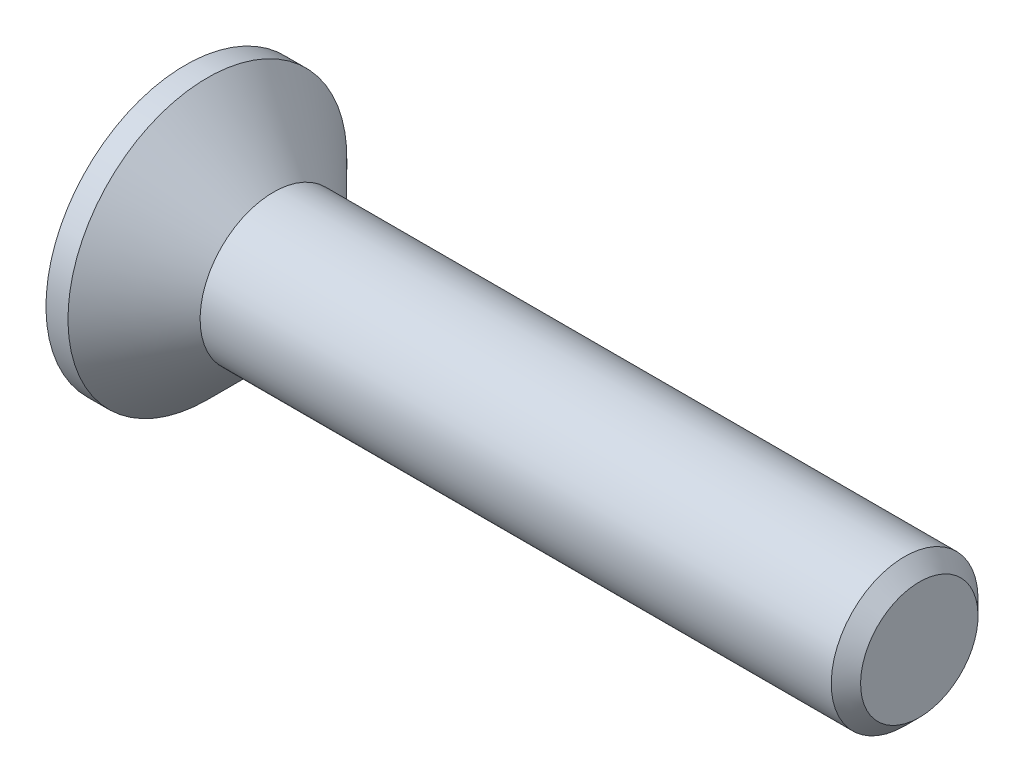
ISO-10303-21;
HEADER;
FILE_DESCRIPTION(('STEP AP214'),'2;1');
FILE_NAME('part.step','',(''),(''),'','','');
FILE_SCHEMA(('AUTOMOTIVE_DESIGN { 1 0 10303 214 1 1 1 1 }'));
ENDSEC;
DATA;
#1=APPLICATION_CONTEXT('core data for automotive mechanical design processes');
#2=APPLICATION_PROTOCOL_DEFINITION('international standard','automotive_design',2000,#1);
#3=PRODUCT_CONTEXT('',#1,'mechanical');
#4=PRODUCT('Part','Part','',(#3));
#5=PRODUCT_RELATED_PRODUCT_CATEGORY('part','',(#4));
#6=PRODUCT_DEFINITION_FORMATION('','',#4);
#7=PRODUCT_DEFINITION_CONTEXT('part definition',#1,'design');
#8=PRODUCT_DEFINITION('design','',#6,#7);
#9=PRODUCT_DEFINITION_SHAPE('','',#8);
#10=(LENGTH_UNIT() NAMED_UNIT(*) SI_UNIT(.MILLI.,.METRE.));
#11=(NAMED_UNIT(*) PLANE_ANGLE_UNIT() SI_UNIT($,.RADIAN.));
#12=(NAMED_UNIT(*) SI_UNIT($,.STERADIAN.) SOLID_ANGLE_UNIT());
#13=UNCERTAINTY_MEASURE_WITH_UNIT(LENGTH_MEASURE(1.E-05),#10,'distance_accuracy_value','');
#14=(GEOMETRIC_REPRESENTATION_CONTEXT(3) GLOBAL_UNCERTAINTY_ASSIGNED_CONTEXT((#13)) GLOBAL_UNIT_ASSIGNED_CONTEXT((#10,
#11,#12)) REPRESENTATION_CONTEXT('',''));
#15=CARTESIAN_POINT('',(0.,0.,0.));
#16=DIRECTION('',(0.,0.,1.));
#17=DIRECTION('',(1.,0.,0.));
#18=AXIS2_PLACEMENT_3D('',#15,#16,#17);
#19=CARTESIAN_POINT('',(0.,0.,0.));
#20=DIRECTION('',(-1.,0.,0.));
#21=DIRECTION('',(0.,-1.,0.));
#22=AXIS2_PLACEMENT_3D('',#19,#20,#21);
#23=CONICAL_SURFACE('',#22,1.,0.78539816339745);
#24=CARTESIAN_POINT('',(-0.899999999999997,0.,0.));
#25=DIRECTION('',(-1.,0.,0.));
#26=DIRECTION('',(0.,-1.,0.));
#27=AXIS2_PLACEMENT_3D('',#24,#25,#26);
#28=CIRCLE('',#27,1.9);
#29=CARTESIAN_POINT('',(-0.899999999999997,-1.9,0.));
#30=VERTEX_POINT('',#29);
#31=EDGE_CURVE('E189',#30,#30,#28,.T.);
#32=ORIENTED_EDGE('',*,*,#31,.F.);
#33=EDGE_LOOP('',(#32));
#34=FACE_BOUND('',#33,.T.);
#35=CARTESIAN_POINT('',(0.,0.,0.));
#36=DIRECTION('',(-1.,0.,0.));
#37=DIRECTION('',(0.,-1.,0.));
#38=AXIS2_PLACEMENT_3D('',#35,#36,#37);
#39=CIRCLE('',#38,1.);
#40=CARTESIAN_POINT('',(0.,-1.,0.));
#41=VERTEX_POINT('',#40);
#42=EDGE_CURVE('E212',#41,#41,#39,.T.);
#43=ORIENTED_EDGE('',*,*,#42,.T.);
#44=EDGE_LOOP('',(#43));
#45=FACE_BOUND('',#44,.T.);
#46=ADVANCED_FACE('F33',(#34,#45),#23,.T.);
#47=CARTESIAN_POINT('',(-1.2,0.,0.));
#48=DIRECTION('',(-1.,0.,0.));
#49=DIRECTION('',(0.,-1.,0.));
#50=AXIS2_PLACEMENT_3D('',#47,#48,#49);
#51=CYLINDRICAL_SURFACE('',#50,1.);
#52=CARTESIAN_POINT('',(8.6,0.,0.));
#53=DIRECTION('',(-1.,0.,0.));
#54=DIRECTION('',(0.,-1.,0.));
#55=AXIS2_PLACEMENT_3D('',#52,#53,#54);
#56=CIRCLE('',#55,1.);
#57=CARTESIAN_POINT('',(8.6,-1.,0.));
#58=VERTEX_POINT('',#57);
#59=EDGE_CURVE('E41',#58,#58,#56,.T.);
#60=ORIENTED_EDGE('',*,*,#59,.T.);
#61=EDGE_LOOP('',(#60));
#62=FACE_BOUND('',#61,.T.);
#63=ORIENTED_EDGE('',*,*,#42,.F.);
#64=EDGE_LOOP('',(#63));
#65=FACE_BOUND('',#64,.T.);
#66=ADVANCED_FACE('F217',(#62,#65),#51,.T.);
#67=CARTESIAN_POINT('',(8.8,0.,0.));
#68=DIRECTION('',(-1.,0.,0.));
#69=DIRECTION('',(0.,-1.,0.));
#70=AXIS2_PLACEMENT_3D('',#67,#68,#69);
#71=PLANE('',#70);
#72=CARTESIAN_POINT('',(8.8,0.,0.));
#73=DIRECTION('',(-1.,0.,0.));
#74=DIRECTION('',(0.,-1.,0.));
#75=AXIS2_PLACEMENT_3D('',#72,#73,#74);
#76=CIRCLE('',#75,0.799999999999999);
#77=CARTESIAN_POINT('',(8.8,-0.799999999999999,0.));
#78=VERTEX_POINT('',#77);
#79=EDGE_CURVE('E11',#78,#78,#76,.F.);
#80=ORIENTED_EDGE('',*,*,#79,.T.);
#81=EDGE_LOOP('',(#80));
#82=FACE_BOUND('',#81,.T.);
#83=ADVANCED_FACE('F239',(#82),#71,.F.);
#84=CARTESIAN_POINT('',(-1.2,1.9,0.));
#85=DIRECTION('',(1.,0.,0.));
#86=DIRECTION('',(0.,1.,0.));
#87=AXIS2_PLACEMENT_3D('',#84,#85,#86);
#88=PLANE('',#87);
#89=DIRECTION('',(0.,0.,-1.));
#90=VECTOR('',#89,1.);
#91=CARTESIAN_POINT('',(-1.2,0.3,-1.175));
#92=LINE('',#91,#90);
#93=CARTESIAN_POINT('',(-1.2,0.3,-0.3));
#94=VERTEX_POINT('',#93);
#95=CARTESIAN_POINT('',(-1.2,0.3,-1.175));
#96=VERTEX_POINT('',#95);
#97=EDGE_CURVE('E158',#94,#96,#92,.T.);
#98=ORIENTED_EDGE('',*,*,#97,.F.);
#99=DIRECTION('',(0.,-1.,0.));
#100=VECTOR('',#99,1.);
#101=CARTESIAN_POINT('',(-1.2,0.3,-0.3));
#102=LINE('',#101,#100);
#103=CARTESIAN_POINT('',(-1.2,1.175,-0.3));
#104=VERTEX_POINT('',#103);
#105=EDGE_CURVE('E48',#104,#94,#102,.T.);
#106=ORIENTED_EDGE('',*,*,#105,.F.);
#107=DIRECTION('',(0.,0.,-1.));
#108=VECTOR('',#107,1.);
#109=CARTESIAN_POINT('',(-1.2,1.175,-0.3));
#110=LINE('',#109,#108);
#111=CARTESIAN_POINT('',(-1.2,1.175,0.3));
#112=VERTEX_POINT('',#111);
#113=EDGE_CURVE('E185',#112,#104,#110,.T.);
#114=ORIENTED_EDGE('',*,*,#113,.F.);
#115=DIRECTION('',(0.,1.,0.));
#116=VECTOR('',#115,1.);
#117=CARTESIAN_POINT('',(-1.2,1.175,0.3));
#118=LINE('',#117,#116);
#119=CARTESIAN_POINT('',(-1.2,0.3,0.3));
#120=VERTEX_POINT('',#119);
#121=EDGE_CURVE('E183',#120,#112,#118,.T.);
#122=ORIENTED_EDGE('',*,*,#121,.F.);
#123=DIRECTION('',(0.,0.,-1.));
#124=VECTOR('',#123,1.);
#125=CARTESIAN_POINT('',(-1.2,0.3,0.3));
#126=LINE('',#125,#124);
#127=CARTESIAN_POINT('',(-1.2,0.3,1.175));
#128=VERTEX_POINT('',#127);
#129=EDGE_CURVE('E132',#128,#120,#126,.T.);
#130=ORIENTED_EDGE('',*,*,#129,.F.);
#131=DIRECTION('',(0.,1.,0.));
#132=VECTOR('',#131,1.);
#133=CARTESIAN_POINT('',(-1.2,0.3,1.175));
#134=LINE('',#133,#132);
#135=CARTESIAN_POINT('',(-1.2,-0.3,1.175));
#136=VERTEX_POINT('',#135);
#137=EDGE_CURVE('E179',#136,#128,#134,.T.);
#138=ORIENTED_EDGE('',*,*,#137,.F.);
#139=DIRECTION('',(0.,0.,1.));
#140=VECTOR('',#139,1.);
#141=CARTESIAN_POINT('',(-1.2,-0.3,1.175));
#142=LINE('',#141,#140);
#143=CARTESIAN_POINT('',(-1.2,-0.3,0.3));
#144=VERTEX_POINT('',#143);
#145=EDGE_CURVE('E176',#144,#136,#142,.T.);
#146=ORIENTED_EDGE('',*,*,#145,.F.);
#147=DIRECTION('',(0.,1.,0.));
#148=VECTOR('',#147,1.);
#149=CARTESIAN_POINT('',(-1.2,-0.3,0.3));
#150=LINE('',#149,#148);
#151=CARTESIAN_POINT('',(-1.2,-1.175,0.3));
#152=VERTEX_POINT('',#151);
#153=EDGE_CURVE('E173',#152,#144,#150,.T.);
#154=ORIENTED_EDGE('',*,*,#153,.F.);
#155=DIRECTION('',(0.,0.,1.));
#156=VECTOR('',#155,1.);
#157=CARTESIAN_POINT('',(-1.2,-1.175,0.3));
#158=LINE('',#157,#156);
#159=CARTESIAN_POINT('',(-1.2,-1.175,-0.3));
#160=VERTEX_POINT('',#159);
#161=EDGE_CURVE('E170',#160,#152,#158,.T.);
#162=ORIENTED_EDGE('',*,*,#161,.F.);
#163=DIRECTION('',(0.,-1.,0.));
#164=VECTOR('',#163,1.);
#165=CARTESIAN_POINT('',(-1.2,-1.175,-0.3));
#166=LINE('',#165,#164);
#167=CARTESIAN_POINT('',(-1.2,-0.3,-0.3));
#168=VERTEX_POINT('',#167);
#169=EDGE_CURVE('E167',#168,#160,#166,.T.);
#170=ORIENTED_EDGE('',*,*,#169,.F.);
#171=DIRECTION('',(0.,0.,1.));
#172=VECTOR('',#171,1.);
#173=CARTESIAN_POINT('',(-1.2,-0.3,-0.3));
#174=LINE('',#173,#172);
#175=CARTESIAN_POINT('',(-1.2,-0.3,-1.175));
#176=VERTEX_POINT('',#175);
#177=EDGE_CURVE('E164',#176,#168,#174,.T.);
#178=ORIENTED_EDGE('',*,*,#177,.F.);
#179=DIRECTION('',(0.,-1.,0.));
#180=VECTOR('',#179,1.);
#181=CARTESIAN_POINT('',(-1.2,-0.3,-1.175));
#182=LINE('',#181,#180);
#183=EDGE_CURVE('E161',#96,#176,#182,.T.);
#184=ORIENTED_EDGE('',*,*,#183,.F.);
#185=EDGE_LOOP('',(#98,#106,#114,#122,#130,#138,#146,#154,#162,#170,#178,#184));
#186=FACE_BOUND('',#185,.T.);
#187=CARTESIAN_POINT('',(-1.2,0.,0.));
#188=DIRECTION('',(-1.,0.,0.));
#189=DIRECTION('',(0.,-1.,0.));
#190=AXIS2_PLACEMENT_3D('',#187,#188,#189);
#191=CIRCLE('',#190,1.9);
#192=CARTESIAN_POINT('',(-1.2,-1.9,0.));
#193=VERTEX_POINT('',#192);
#194=EDGE_CURVE('E209',#193,#193,#191,.T.);
#195=ORIENTED_EDGE('',*,*,#194,.T.);
#196=EDGE_LOOP('',(#195));
#197=FACE_BOUND('',#196,.T.);
#198=ADVANCED_FACE('F230',(#186,#197),#88,.F.);
#199=CARTESIAN_POINT('',(-1.2,0.,0.));
#200=DIRECTION('',(-1.,0.,0.));
#201=DIRECTION('',(0.,-1.,0.));
#202=AXIS2_PLACEMENT_3D('',#199,#200,#201);
#203=CYLINDRICAL_SURFACE('',#202,1.9);
#204=ORIENTED_EDGE('',*,*,#194,.F.);
#205=EDGE_LOOP('',(#204));
#206=FACE_BOUND('',#205,.T.);
#207=ORIENTED_EDGE('',*,*,#31,.T.);
#208=EDGE_LOOP('',(#207));
#209=FACE_BOUND('',#208,.T.);
#210=ADVANCED_FACE('F222',(#206,#209),#203,.T.);
#211=CARTESIAN_POINT('',(8.6,0.,0.));
#212=DIRECTION('',(-1.,0.,0.));
#213=DIRECTION('',(0.,-1.,0.));
#214=AXIS2_PLACEMENT_3D('',#211,#212,#213);
#215=CONICAL_SURFACE('',#214,1.,0.785398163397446);
#216=ORIENTED_EDGE('',*,*,#79,.F.);
#217=EDGE_LOOP('',(#216));
#218=FACE_BOUND('',#217,.T.);
#219=ORIENTED_EDGE('',*,*,#59,.F.);
#220=EDGE_LOOP('',(#219));
#221=FACE_BOUND('',#220,.T.);
#222=ADVANCED_FACE('F35',(#218,#221),#215,.T.);
#223=CARTESIAN_POINT('',(-0.249999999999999,0.3,-0.3));
#224=DIRECTION('',(0.,0.,-1.));
#225=DIRECTION('',(0.,1.,0.));
#226=AXIS2_PLACEMENT_3D('',#223,#224,#225);
#227=PLANE('',#226);
#228=ORIENTED_EDGE('',*,*,#105,.T.);
#229=DIRECTION('',(-1.,0.,0.));
#230=VECTOR('',#229,1.);
#231=CARTESIAN_POINT('',(-0.249999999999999,0.3,-0.3));
#232=LINE('',#231,#230);
#233=CARTESIAN_POINT('',(-0.249999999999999,0.3,-0.3));
#234=VERTEX_POINT('',#233);
#235=EDGE_CURVE('E96',#234,#94,#232,.T.);
#236=ORIENTED_EDGE('',*,*,#235,.F.);
#237=DIRECTION('',(0.,-1.,0.));
#238=VECTOR('',#237,1.);
#239=CARTESIAN_POINT('',(-0.249999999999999,0.3,-0.3));
#240=LINE('',#239,#238);
#241=CARTESIAN_POINT('',(-0.249999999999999,1.175,-0.3));
#242=VERTEX_POINT('',#241);
#243=EDGE_CURVE('E187',#242,#234,#240,.T.);
#244=ORIENTED_EDGE('',*,*,#243,.F.);
#245=DIRECTION('',(-1.,0.,0.));
#246=VECTOR('',#245,1.);
#247=CARTESIAN_POINT('',(-0.249999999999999,1.175,-0.3));
#248=LINE('',#247,#246);
#249=EDGE_CURVE('E56',#242,#104,#248,.T.);
#250=ORIENTED_EDGE('',*,*,#249,.T.);
#251=EDGE_LOOP('',(#228,#236,#244,#250));
#252=FACE_BOUND('',#251,.T.);
#253=ADVANCED_FACE('F221',(#252),#227,.F.);
#254=CARTESIAN_POINT('',(-0.249999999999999,1.175,-0.3));
#255=DIRECTION('',(0.,1.,0.));
#256=DIRECTION('',(-1.,0.,0.));
#257=AXIS2_PLACEMENT_3D('',#254,#255,#256);
#258=PLANE('',#257);
#259=ORIENTED_EDGE('',*,*,#113,.T.);
#260=ORIENTED_EDGE('',*,*,#249,.F.);
#261=DIRECTION('',(0.,0.,-1.));
#262=VECTOR('',#261,1.);
#263=CARTESIAN_POINT('',(-0.249999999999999,1.175,-0.3));
#264=LINE('',#263,#262);
#265=CARTESIAN_POINT('',(-0.249999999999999,1.175,0.3));
#266=VERTEX_POINT('',#265);
#267=EDGE_CURVE('E144',#266,#242,#264,.T.);
#268=ORIENTED_EDGE('',*,*,#267,.F.);
#269=DIRECTION('',(-1.,0.,0.));
#270=VECTOR('',#269,1.);
#271=CARTESIAN_POINT('',(-0.249999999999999,1.175,0.3));
#272=LINE('',#271,#270);
#273=EDGE_CURVE('E136',#266,#112,#272,.T.);
#274=ORIENTED_EDGE('',*,*,#273,.T.);
#275=EDGE_LOOP('',(#259,#260,#268,#274));
#276=FACE_BOUND('',#275,.T.);
#277=ADVANCED_FACE('F228',(#276),#258,.F.);
#278=CARTESIAN_POINT('',(-0.249999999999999,1.175,0.3));
#279=DIRECTION('',(0.,0.,1.));
#280=DIRECTION('',(0.,-1.,0.));
#281=AXIS2_PLACEMENT_3D('',#278,#279,#280);
#282=PLANE('',#281);
#283=ORIENTED_EDGE('',*,*,#121,.T.);
#284=ORIENTED_EDGE('',*,*,#273,.F.);
#285=DIRECTION('',(0.,1.,0.));
#286=VECTOR('',#285,1.);
#287=CARTESIAN_POINT('',(-0.249999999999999,1.175,0.3));
#288=LINE('',#287,#286);
#289=CARTESIAN_POINT('',(-0.249999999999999,0.3,0.3));
#290=VERTEX_POINT('',#289);
#291=EDGE_CURVE('E140',#290,#266,#288,.T.);
#292=ORIENTED_EDGE('',*,*,#291,.F.);
#293=DIRECTION('',(-1.,0.,0.));
#294=VECTOR('',#293,1.);
#295=CARTESIAN_POINT('',(-0.249999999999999,0.3,0.3));
#296=LINE('',#295,#294);
#297=EDGE_CURVE('E125',#290,#120,#296,.T.);
#298=ORIENTED_EDGE('',*,*,#297,.T.);
#299=EDGE_LOOP('',(#283,#284,#292,#298));
#300=FACE_BOUND('',#299,.T.);
#301=ADVANCED_FACE('F141',(#300),#282,.F.);
#302=CARTESIAN_POINT('',(-0.249999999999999,0.3,0.3));
#303=DIRECTION('',(0.,1.,0.));
#304=DIRECTION('',(0.,0.,1.));
#305=AXIS2_PLACEMENT_3D('',#302,#303,#304);
#306=PLANE('',#305);
#307=ORIENTED_EDGE('',*,*,#129,.T.);
#308=ORIENTED_EDGE('',*,*,#297,.F.);
#309=DIRECTION('',(0.,0.,-1.));
#310=VECTOR('',#309,1.);
#311=CARTESIAN_POINT('',(-0.249999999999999,0.3,0.3));
#312=LINE('',#311,#310);
#313=CARTESIAN_POINT('',(-0.249999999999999,0.3,1.175));
#314=VERTEX_POINT('',#313);
#315=EDGE_CURVE('E129',#314,#290,#312,.T.);
#316=ORIENTED_EDGE('',*,*,#315,.F.);
#317=DIRECTION('',(-1.,0.,0.));
#318=VECTOR('',#317,1.);
#319=CARTESIAN_POINT('',(-0.249999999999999,0.3,1.175));
#320=LINE('',#319,#318);
#321=EDGE_CURVE('E137',#314,#128,#320,.T.);
#322=ORIENTED_EDGE('',*,*,#321,.T.);
#323=EDGE_LOOP('',(#307,#308,#316,#322));
#324=FACE_BOUND('',#323,.T.);
#325=ADVANCED_FACE('F127',(#324),#306,.F.);
#326=CARTESIAN_POINT('',(-0.249999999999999,0.3,1.175));
#327=DIRECTION('',(0.,0.,1.));
#328=DIRECTION('',(1.,0.,0.));
#329=AXIS2_PLACEMENT_3D('',#326,#327,#328);
#330=PLANE('',#329);
#331=ORIENTED_EDGE('',*,*,#137,.T.);
#332=ORIENTED_EDGE('',*,*,#321,.F.);
#333=DIRECTION('',(0.,1.,0.));
#334=VECTOR('',#333,1.);
#335=CARTESIAN_POINT('',(-0.249999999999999,0.3,1.175));
#336=LINE('',#335,#334);
#337=CARTESIAN_POINT('',(-0.249999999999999,-0.3,1.175));
#338=VERTEX_POINT('',#337);
#339=EDGE_CURVE('E150',#338,#314,#336,.T.);
#340=ORIENTED_EDGE('',*,*,#339,.F.);
#341=DIRECTION('',(-1.,0.,0.));
#342=VECTOR('',#341,1.);
#343=CARTESIAN_POINT('',(-0.249999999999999,-0.3,1.175));
#344=LINE('',#343,#342);
#345=EDGE_CURVE('E192',#338,#136,#344,.T.);
#346=ORIENTED_EDGE('',*,*,#345,.T.);
#347=EDGE_LOOP('',(#331,#332,#340,#346));
#348=FACE_BOUND('',#347,.T.);
#349=ADVANCED_FACE('F277',(#348),#330,.F.);
#350=CARTESIAN_POINT('',(-0.249999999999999,-0.3,1.175));
#351=DIRECTION('',(0.,-1.,0.));
#352=DIRECTION('',(0.,0.,-1.));
#353=AXIS2_PLACEMENT_3D('',#350,#351,#352);
#354=PLANE('',#353);
#355=ORIENTED_EDGE('',*,*,#145,.T.);
#356=ORIENTED_EDGE('',*,*,#345,.F.);
#357=DIRECTION('',(0.,0.,1.));
#358=VECTOR('',#357,1.);
#359=CARTESIAN_POINT('',(-0.249999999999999,-0.3,1.175));
#360=LINE('',#359,#358);
#361=CARTESIAN_POINT('',(-0.249999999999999,-0.3,0.3));
#362=VERTEX_POINT('',#361);
#363=EDGE_CURVE('E152',#362,#338,#360,.T.);
#364=ORIENTED_EDGE('',*,*,#363,.F.);
#365=DIRECTION('',(-1.,0.,0.));
#366=VECTOR('',#365,1.);
#367=CARTESIAN_POINT('',(-0.249999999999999,-0.3,0.3));
#368=LINE('',#367,#366);
#369=EDGE_CURVE('E194',#362,#144,#368,.T.);
#370=ORIENTED_EDGE('',*,*,#369,.T.);
#371=EDGE_LOOP('',(#355,#356,#364,#370));
#372=FACE_BOUND('',#371,.T.);
#373=ADVANCED_FACE('F273',(#372),#354,.F.);
#374=CARTESIAN_POINT('',(-0.249999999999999,-0.3,0.3));
#375=DIRECTION('',(0.,0.,1.));
#376=DIRECTION('',(1.,0.,0.));
#377=AXIS2_PLACEMENT_3D('',#374,#375,#376);
#378=PLANE('',#377);
#379=ORIENTED_EDGE('',*,*,#153,.T.);
#380=ORIENTED_EDGE('',*,*,#369,.F.);
#381=DIRECTION('',(0.,1.,0.));
#382=VECTOR('',#381,1.);
#383=CARTESIAN_POINT('',(-0.249999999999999,-0.3,0.3));
#384=LINE('',#383,#382);
#385=CARTESIAN_POINT('',(-0.249999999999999,-1.175,0.3));
#386=VERTEX_POINT('',#385);
#387=EDGE_CURVE('E422',#386,#362,#384,.T.);
#388=ORIENTED_EDGE('',*,*,#387,.F.);
#389=DIRECTION('',(-1.,0.,0.));
#390=VECTOR('',#389,1.);
#391=CARTESIAN_POINT('',(-0.249999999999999,-1.175,0.3));
#392=LINE('',#391,#390);
#393=EDGE_CURVE('E196',#386,#152,#392,.T.);
#394=ORIENTED_EDGE('',*,*,#393,.T.);
#395=EDGE_LOOP('',(#379,#380,#388,#394));
#396=FACE_BOUND('',#395,.T.);
#397=ADVANCED_FACE('F269',(#396),#378,.F.);
#398=CARTESIAN_POINT('',(-0.249999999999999,-1.175,0.3));
#399=DIRECTION('',(0.,-1.,0.));
#400=DIRECTION('',(1.,0.,0.));
#401=AXIS2_PLACEMENT_3D('',#398,#399,#400);
#402=PLANE('',#401);
#403=ORIENTED_EDGE('',*,*,#161,.T.);
#404=ORIENTED_EDGE('',*,*,#393,.F.);
#405=DIRECTION('',(0.,0.,1.));
#406=VECTOR('',#405,1.);
#407=CARTESIAN_POINT('',(-0.249999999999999,-1.175,0.3));
#408=LINE('',#407,#406);
#409=CARTESIAN_POINT('',(-0.249999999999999,-1.175,-0.3));
#410=VERTEX_POINT('',#409);
#411=EDGE_CURVE('E419',#410,#386,#408,.T.);
#412=ORIENTED_EDGE('',*,*,#411,.F.);
#413=DIRECTION('',(-1.,0.,0.));
#414=VECTOR('',#413,1.);
#415=CARTESIAN_POINT('',(-0.249999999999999,-1.175,-0.3));
#416=LINE('',#415,#414);
#417=EDGE_CURVE('E198',#410,#160,#416,.T.);
#418=ORIENTED_EDGE('',*,*,#417,.T.);
#419=EDGE_LOOP('',(#403,#404,#412,#418));
#420=FACE_BOUND('',#419,.T.);
#421=ADVANCED_FACE('F265',(#420),#402,.F.);
#422=CARTESIAN_POINT('',(-0.249999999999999,-1.175,-0.3));
#423=DIRECTION('',(0.,0.,-1.));
#424=DIRECTION('',(0.,1.,0.));
#425=AXIS2_PLACEMENT_3D('',#422,#423,#424);
#426=PLANE('',#425);
#427=ORIENTED_EDGE('',*,*,#169,.T.);
#428=ORIENTED_EDGE('',*,*,#417,.F.);
#429=DIRECTION('',(0.,-1.,0.));
#430=VECTOR('',#429,1.);
#431=CARTESIAN_POINT('',(-0.249999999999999,-1.175,-0.3));
#432=LINE('',#431,#430);
#433=CARTESIAN_POINT('',(-0.249999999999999,-0.3,-0.3));
#434=VERTEX_POINT('',#433);
#435=EDGE_CURVE('E416',#434,#410,#432,.T.);
#436=ORIENTED_EDGE('',*,*,#435,.F.);
#437=DIRECTION('',(-1.,0.,0.));
#438=VECTOR('',#437,1.);
#439=CARTESIAN_POINT('',(-0.249999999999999,-0.3,-0.3));
#440=LINE('',#439,#438);
#441=EDGE_CURVE('E200',#434,#168,#440,.T.);
#442=ORIENTED_EDGE('',*,*,#441,.T.);
#443=EDGE_LOOP('',(#427,#428,#436,#442));
#444=FACE_BOUND('',#443,.T.);
#445=ADVANCED_FACE('F261',(#444),#426,.F.);
#446=CARTESIAN_POINT('',(-0.249999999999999,-0.3,-0.3));
#447=DIRECTION('',(0.,-1.,0.));
#448=DIRECTION('',(0.,0.,-1.));
#449=AXIS2_PLACEMENT_3D('',#446,#447,#448);
#450=PLANE('',#449);
#451=ORIENTED_EDGE('',*,*,#177,.T.);
#452=ORIENTED_EDGE('',*,*,#441,.F.);
#453=DIRECTION('',(0.,0.,1.));
#454=VECTOR('',#453,1.);
#455=CARTESIAN_POINT('',(-0.249999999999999,-0.3,-0.3));
#456=LINE('',#455,#454);
#457=CARTESIAN_POINT('',(-0.249999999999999,-0.3,-1.175));
#458=VERTEX_POINT('',#457);
#459=EDGE_CURVE('E413',#458,#434,#456,.T.);
#460=ORIENTED_EDGE('',*,*,#459,.F.);
#461=DIRECTION('',(-1.,0.,0.));
#462=VECTOR('',#461,1.);
#463=CARTESIAN_POINT('',(-0.249999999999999,-0.3,-1.175));
#464=LINE('',#463,#462);
#465=EDGE_CURVE('E202',#458,#176,#464,.T.);
#466=ORIENTED_EDGE('',*,*,#465,.T.);
#467=EDGE_LOOP('',(#451,#452,#460,#466));
#468=FACE_BOUND('',#467,.T.);
#469=ADVANCED_FACE('F257',(#468),#450,.F.);
#470=CARTESIAN_POINT('',(-0.249999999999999,-0.3,-1.175));
#471=DIRECTION('',(0.,0.,-1.));
#472=DIRECTION('',(-1.,0.,0.));
#473=AXIS2_PLACEMENT_3D('',#470,#471,#472);
#474=PLANE('',#473);
#475=ORIENTED_EDGE('',*,*,#183,.T.);
#476=ORIENTED_EDGE('',*,*,#465,.F.);
#477=DIRECTION('',(0.,-1.,0.));
#478=VECTOR('',#477,1.);
#479=CARTESIAN_POINT('',(-0.249999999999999,-0.3,-1.175));
#480=LINE('',#479,#478);
#481=CARTESIAN_POINT('',(-0.249999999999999,0.3,-1.175));
#482=VERTEX_POINT('',#481);
#483=EDGE_CURVE('E408',#482,#458,#480,.T.);
#484=ORIENTED_EDGE('',*,*,#483,.F.);
#485=DIRECTION('',(-1.,0.,0.));
#486=VECTOR('',#485,1.);
#487=CARTESIAN_POINT('',(-0.249999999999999,0.3,-1.175));
#488=LINE('',#487,#486);
#489=EDGE_CURVE('E204',#482,#96,#488,.T.);
#490=ORIENTED_EDGE('',*,*,#489,.T.);
#491=EDGE_LOOP('',(#475,#476,#484,#490));
#492=FACE_BOUND('',#491,.T.);
#493=ADVANCED_FACE('F253',(#492),#474,.F.);
#494=CARTESIAN_POINT('',(-0.249999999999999,0.3,-1.175));
#495=DIRECTION('',(0.,1.,0.));
#496=DIRECTION('',(0.,0.,1.));
#497=AXIS2_PLACEMENT_3D('',#494,#495,#496);
#498=PLANE('',#497);
#499=ORIENTED_EDGE('',*,*,#97,.T.);
#500=ORIENTED_EDGE('',*,*,#489,.F.);
#501=DIRECTION('',(0.,0.,-1.));
#502=VECTOR('',#501,1.);
#503=CARTESIAN_POINT('',(-0.249999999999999,0.3,-1.175));
#504=LINE('',#503,#502);
#505=EDGE_CURVE('E406',#234,#482,#504,.T.);
#506=ORIENTED_EDGE('',*,*,#505,.F.);
#507=ORIENTED_EDGE('',*,*,#235,.T.);
#508=EDGE_LOOP('',(#499,#500,#506,#507));
#509=FACE_BOUND('',#508,.T.);
#510=ADVANCED_FACE('F250',(#509),#498,.F.);
#511=CARTESIAN_POINT('',(-0.249999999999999,0.,0.));
#512=DIRECTION('',(1.,0.,0.));
#513=DIRECTION('',(0.,0.,-1.));
#514=AXIS2_PLACEMENT_3D('',#511,#512,#513);
#515=PLANE('',#514);
#516=ORIENTED_EDGE('',*,*,#243,.T.);
#517=ORIENTED_EDGE('',*,*,#505,.T.);
#518=ORIENTED_EDGE('',*,*,#483,.T.);
#519=ORIENTED_EDGE('',*,*,#459,.T.);
#520=ORIENTED_EDGE('',*,*,#435,.T.);
#521=ORIENTED_EDGE('',*,*,#411,.T.);
#522=ORIENTED_EDGE('',*,*,#387,.T.);
#523=ORIENTED_EDGE('',*,*,#363,.T.);
#524=ORIENTED_EDGE('',*,*,#339,.T.);
#525=ORIENTED_EDGE('',*,*,#315,.T.);
#526=ORIENTED_EDGE('',*,*,#291,.T.);
#527=ORIENTED_EDGE('',*,*,#267,.T.);
#528=EDGE_LOOP('',(#516,#517,#518,#519,#520,#521,#522,#523,#524,#525,#526,#527));
#529=FACE_BOUND('',#528,.T.);
#530=ADVANCED_FACE('F147',(#529),#515,.F.);
#531=CLOSED_SHELL('',(#46,#66,#83,#198,#210,#222,#253,#277,#301,#325,#349,#373,#397,#421,#445,
#469,#493,#510,#530));
#532=MANIFOLD_SOLID_BREP('B2',#531);
#533=ADVANCED_BREP_SHAPE_REPRESENTATION('',(#18,#532),#14);
#534=SHAPE_DEFINITION_REPRESENTATION(#9,#533);
ENDSEC;
END-ISO-10303-21;
